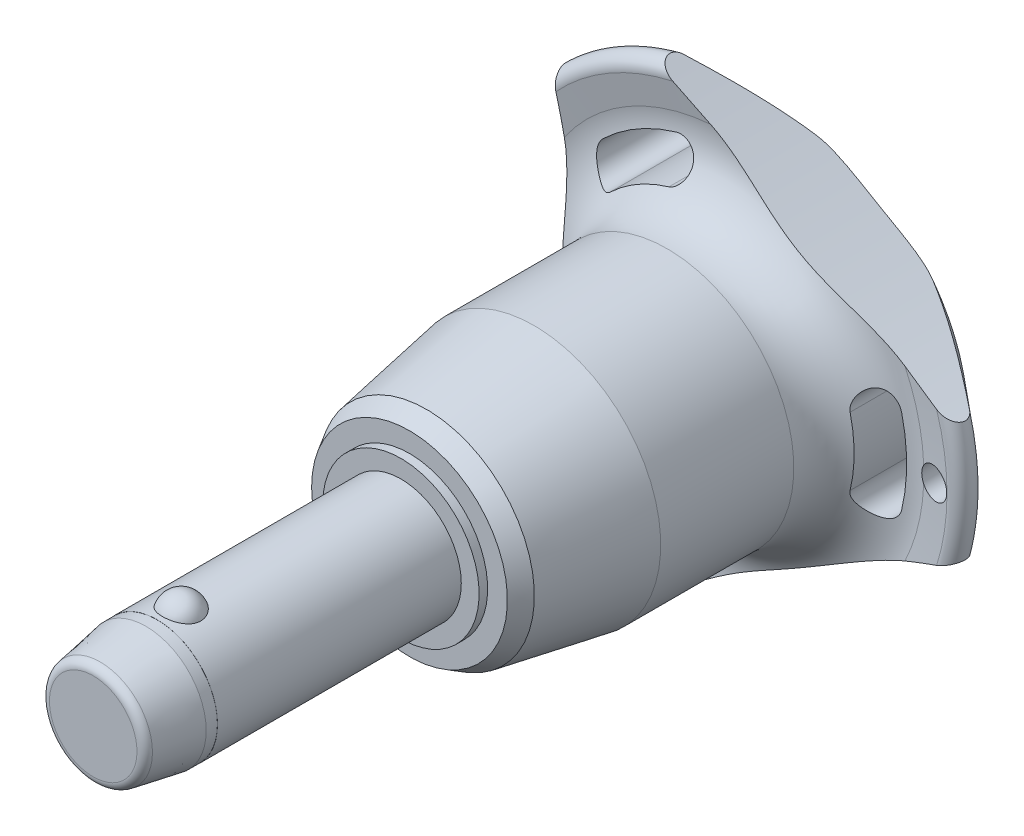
from build123d import *

# Parameters (mm, degrees)
SKETCH1_R           = 6
BOSS_EXTRUDE1_DEPTH = 20
SKETCH2_R           = 5.15
BOSS_EXTRUDE2_DEPTH = 39.7
BOSS_EXTRUDE3_START = 10.6
SKETCH1_2_R         = 6
BOSS_EXTRUDE3_DEPTH = 10.6
CHAMFER1_SIZE       = 5.3
CHAMFER1_SIZE2      = 0.934532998
FILLET1_R           = 0.85
SKETCH6_R           = 144.275
CUT_EXTRUDE1_DEPTH  = 69.537041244
CIRPATTERN1_COUNT   = 3
SKETCH7_R           = 1.5
CUT_EXTRUDE2_DEPTH  = 69.243593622
SKETCH8_R           = 6
SKETCH8_R_2         = 5.99
CUT_EXTRUDE3_DEPTH  = 6.36


with BuildPart() as part:
    # Sketch1 → Boss-Extrude1 (new body)
    with BuildSketch(Plane.XY):
        Circle(SKETCH1_R)
    extrude(amount=-BOSS_EXTRUDE1_DEPTH)

    # Sketch2 → Boss-Extrude2 (add)
    with BuildSketch(Plane(origin=(0, 0, -20), x_dir=(-1, 0, 0), z_dir=(0, 0, -1))):
        Circle(SKETCH2_R)
    extrude(amount=BOSS_EXTRUDE2_DEPTH)

    # Sketch3 → Revolve1 (revolve)
    with BuildSketch(Plane(origin=(0, 0, 0), x_dir=(0, 0, -1), z_dir=(1, 0, 0))):
        with BuildLine():
            Line((-1.854049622, 7.25), (-1.854049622, 3.25))
            ThreePointArc((-1.854049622, 3.25), (0.145950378, 5.25), (-1.854049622, 7.25))
        make_face()
        with BuildLine():
            Line((-1.854049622, -3.25), (-1.854049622, -7.25))
            ThreePointArc((-1.854049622, -7.25), (0.145950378, -5.25), (-1.854049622, -3.25))
        make_face()
    revolve(axis=Axis((0, -3.25, 1.854049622), (0, 1, 0)))

    # Sketch1_2 → Boss-Extrude3 (add)
    with BuildSketch(Plane.XY.offset(BOSS_EXTRUDE3_START)):
        Circle(SKETCH1_2_R)
    extrude(amount=-BOSS_EXTRUDE3_DEPTH)

    # Chamfer1
    chamfer1_edges = [part.edges().sort_by_distance(p)[0] for p in [
        (-6, 0, 10.6),
    ]]
    chamfer1_side = [part.faces().sort_by_distance(p)[0] for p in [
        (-6, 0, -4.7),
    ]]
    chamfer(chamfer1_edges, length=CHAMFER1_SIZE, length2=CHAMFER1_SIZE2, reference=chamfer1_side[0])

    # Fillet1
    fillet1_edges = [part.edges().sort_by_distance(p)[0] for p in [
        (-5.065467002, 0, 10.6),
        (5.15, 0, -59.7),
    ]]
    fillet(fillet1_edges, radius=FILLET1_R)

    # Sketch4 → Revolve2 (revolve)
    with BuildSketch(Plane(origin=(0, 0, 0), x_dir=(0, 0, -1), z_dir=(1, 0, 0)), mode=Mode.PRIVATE) as revolve2_sk:
        Polygon((20, 0), (20, 7.770471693), (20.85, 7.770471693), (20.85, 9.734414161), (22.550824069, 10.716385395), (33.233333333, 12.6), (46.466666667, 12.6), (46.466666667, 0), align=None)
    revolve(revolve2_sk.sketch.rotate(Axis((0, 0, -46.466666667), (0, 0, 1)), 90), axis=Axis((0, 0, -46.466666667), (0, 0, 1)))

    # Sketch5 → Revolve3 (revolve)
    with BuildSketch(Plane(origin=(0, 0, 0), x_dir=(0, 0, -1), z_dir=(1, 0, 0)), mode=Mode.PRIVATE) as revolve3_sk:
        with BuildLine():
            Line((52.379459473, 19.619255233), (51.900774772, 22.396148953))
            ThreePointArc((51.900774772, 22.396148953), (52.578274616, 23.688538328), (54.002586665, 23.371345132))
            Line((54.002586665, 23.371345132), (59.141488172, 17.247040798))
            ThreePointArc((59.141488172, 17.247040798), (59.7, 15.584758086), (58.978803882, 13.986322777))
            ThreePointArc((58.978803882, 13.986322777), (54.617427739, 7.589034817), (53.083333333, 0))
            Line((53.083333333, 0), (46.466666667, 0))
            Line((46.466666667, 0), (46.466666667, 12.6))
            ThreePointArc((46.466666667, 12.6), (51.055540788, 14.734481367), (52.379459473, 19.619255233))
        make_face()
    revolve(revolve3_sk.sketch.rotate(Axis((0, 0, -53.083333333), (0, 0, 1)), 90), axis=Axis((0, 0, -53.083333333), (0, 0, 1)))

    # Sketch6 → Cut-Extrude1 (cut, through all)
    with BuildSketch(Plane.XY):
        with Locations((-159.975, 0)):
            Circle(SKETCH6_R)
        with BuildLine():
            ThreePointArc((17.365443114, -4.192809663), (17.864441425, 0), (17.365443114, 4.192809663))
            ThreePointArc((17.365443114, 4.192809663), (15.247788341, 5.486749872), (13.953848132, 3.369095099))
            ThreePointArc((13.953848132, 3.369095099), (14.354813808, 0), (13.953848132, -3.369095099))
            ThreePointArc((13.953848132, -3.369095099), (15.247788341, -5.486749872), (17.365443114, -4.192809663))
        make_face()
    cut_extrude1 = extrude(amount=-CUT_EXTRUDE1_DEPTH, mode=Mode.SUBTRACT)

    # CirPattern1: Cut-Extrude1 ×3 about axis
    cirpattern1_axis = Axis((0, 0, 0), (0, 0, 1))
    for i in range(1, CIRPATTERN1_COUNT):
        add(cut_extrude1.rotate(cirpattern1_axis, i * 360 / CIRPATTERN1_COUNT), mode=Mode.SUBTRACT)

    # Sketch7 → Cut-Extrude2 (cut, through all)
    with BuildSketch(Plane.XY):
        with Locations(Location((20.864441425, 0, 0), (0, 0, 221.008319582))):
            Circle(SKETCH7_R)
    extrude(amount=-CUT_EXTRUDE2_DEPTH, mode=Mode.SUBTRACT)

    # Sketch8 → Cut-Extrude3 (cut)
    with BuildSketch(Plane.XY.offset(10.6)):
        Circle(SKETCH8_R)
        Circle(SKETCH8_R_2, mode=Mode.SUBTRACT)
    extrude(amount=-CUT_EXTRUDE3_DEPTH, mode=Mode.SUBTRACT)


solid = part.part
